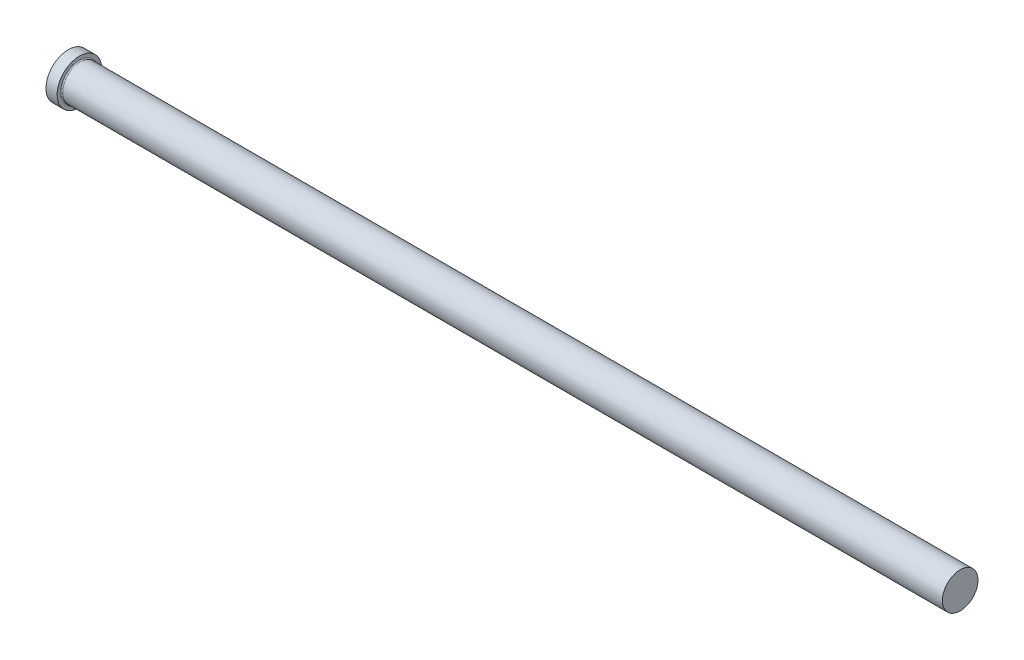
ISO-10303-21;
HEADER;
FILE_DESCRIPTION(('STEP AP214'),'2;1');
FILE_NAME('part.step','',(''),(''),'','','');
FILE_SCHEMA(('AUTOMOTIVE_DESIGN { 1 0 10303 214 1 1 1 1 }'));
ENDSEC;
DATA;
#1=APPLICATION_CONTEXT('core data for automotive mechanical design processes');
#2=APPLICATION_PROTOCOL_DEFINITION('international standard','automotive_design',2000,#1);
#3=PRODUCT_CONTEXT('',#1,'mechanical');
#4=PRODUCT('Part','Part','',(#3));
#5=PRODUCT_RELATED_PRODUCT_CATEGORY('part','',(#4));
#6=PRODUCT_DEFINITION_FORMATION('','',#4);
#7=PRODUCT_DEFINITION_CONTEXT('part definition',#1,'design');
#8=PRODUCT_DEFINITION('design','',#6,#7);
#9=PRODUCT_DEFINITION_SHAPE('','',#8);
#10=(LENGTH_UNIT() NAMED_UNIT(*) SI_UNIT(.MILLI.,.METRE.));
#11=(NAMED_UNIT(*) PLANE_ANGLE_UNIT() SI_UNIT($,.RADIAN.));
#12=(NAMED_UNIT(*) SI_UNIT($,.STERADIAN.) SOLID_ANGLE_UNIT());
#13=UNCERTAINTY_MEASURE_WITH_UNIT(LENGTH_MEASURE(1.E-05),#10,'distance_accuracy_value','');
#14=(GEOMETRIC_REPRESENTATION_CONTEXT(3) GLOBAL_UNCERTAINTY_ASSIGNED_CONTEXT((#13)) GLOBAL_UNIT_ASSIGNED_CONTEXT((#10,
#11,#12)) REPRESENTATION_CONTEXT('',''));
#15=CARTESIAN_POINT('',(0.,0.,0.));
#16=DIRECTION('',(0.,0.,1.));
#17=DIRECTION('',(1.,0.,0.));
#18=AXIS2_PLACEMENT_3D('',#15,#16,#17);
#19=CARTESIAN_POINT('',(0.,0.,0.));
#20=DIRECTION('',(-1.,0.,0.));
#21=DIRECTION('',(0.,-1.,0.));
#22=AXIS2_PLACEMENT_3D('',#19,#20,#21);
#23=PLANE('',#22);
#24=CARTESIAN_POINT('',(0.,0.,0.));
#25=DIRECTION('',(1.,0.,0.));
#26=DIRECTION('',(0.,1.,0.));
#27=AXIS2_PLACEMENT_3D('',#24,#25,#26);
#28=CIRCLE('',#27,20.);
#29=CARTESIAN_POINT('',(0.,20.,0.));
#30=VERTEX_POINT('',#29);
#31=EDGE_CURVE('E25',#30,#30,#28,.T.);
#32=ORIENTED_EDGE('',*,*,#31,.F.);
#33=EDGE_LOOP('',(#32));
#34=FACE_BOUND('',#33,.T.);
#35=ADVANCED_FACE('F14',(#34),#23,.T.);
#36=CARTESIAN_POINT('',(800.,0.,0.));
#37=DIRECTION('',(1.,0.,0.));
#38=DIRECTION('',(0.,1.,0.));
#39=AXIS2_PLACEMENT_3D('',#36,#37,#38);
#40=CYLINDRICAL_SURFACE('',#39,20.);
#41=ORIENTED_EDGE('',*,*,#31,.T.);
#42=EDGE_LOOP('',(#41));
#43=FACE_BOUND('',#42,.T.);
#44=CARTESIAN_POINT('',(10.,0.,0.));
#45=DIRECTION('',(1.,0.,0.));
#46=DIRECTION('',(0.,1.,0.));
#47=AXIS2_PLACEMENT_3D('',#44,#45,#46);
#48=CIRCLE('',#47,20.);
#49=CARTESIAN_POINT('',(10.,20.,0.));
#50=VERTEX_POINT('',#49);
#51=EDGE_CURVE('E29',#50,#50,#48,.T.);
#52=ORIENTED_EDGE('',*,*,#51,.F.);
#53=EDGE_LOOP('',(#52));
#54=FACE_BOUND('',#53,.T.);
#55=ADVANCED_FACE('F51',(#43,#54),#40,.T.);
#56=CARTESIAN_POINT('',(10.,20.,0.));
#57=DIRECTION('',(1.,0.,0.));
#58=DIRECTION('',(0.,1.,0.));
#59=AXIS2_PLACEMENT_3D('',#56,#57,#58);
#60=PLANE('',#59);
#61=CARTESIAN_POINT('',(10.,0.,0.));
#62=DIRECTION('',(1.,0.,0.));
#63=DIRECTION('',(0.,1.,0.));
#64=AXIS2_PLACEMENT_3D('',#61,#62,#63);
#65=CIRCLE('',#64,17.);
#66=CARTESIAN_POINT('',(10.,17.,0.));
#67=VERTEX_POINT('',#66);
#68=EDGE_CURVE('E9',#67,#67,#65,.F.);
#69=ORIENTED_EDGE('',*,*,#68,.T.);
#70=EDGE_LOOP('',(#69));
#71=FACE_BOUND('',#70,.T.);
#72=ORIENTED_EDGE('',*,*,#51,.T.);
#73=EDGE_LOOP('',(#72));
#74=FACE_BOUND('',#73,.T.);
#75=ADVANCED_FACE('F42',(#71,#74),#60,.T.);
#76=CARTESIAN_POINT('',(800.,0.,0.));
#77=DIRECTION('',(1.,0.,0.));
#78=DIRECTION('',(0.,1.,0.));
#79=AXIS2_PLACEMENT_3D('',#76,#77,#78);
#80=CYLINDRICAL_SURFACE('',#79,16.);
#81=CARTESIAN_POINT('',(11.,0.,0.));
#82=DIRECTION('',(1.,0.,0.));
#83=DIRECTION('',(0.,1.,0.));
#84=AXIS2_PLACEMENT_3D('',#81,#82,#83);
#85=CIRCLE('',#84,16.);
#86=CARTESIAN_POINT('',(11.,16.,0.));
#87=VERTEX_POINT('',#86);
#88=EDGE_CURVE('E21',#87,#87,#85,.T.);
#89=ORIENTED_EDGE('',*,*,#88,.T.);
#90=EDGE_LOOP('',(#89));
#91=FACE_BOUND('',#90,.T.);
#92=CARTESIAN_POINT('',(800.,0.,0.));
#93=DIRECTION('',(1.,0.,0.));
#94=DIRECTION('',(0.,1.,0.));
#95=AXIS2_PLACEMENT_3D('',#92,#93,#94);
#96=CIRCLE('',#95,16.);
#97=CARTESIAN_POINT('',(800.,16.,0.));
#98=VERTEX_POINT('',#97);
#99=EDGE_CURVE('E34',#98,#98,#96,.T.);
#100=ORIENTED_EDGE('',*,*,#99,.F.);
#101=EDGE_LOOP('',(#100));
#102=FACE_BOUND('',#101,.T.);
#103=ADVANCED_FACE('F40',(#91,#102),#80,.T.);
#104=CARTESIAN_POINT('',(800.,16.,0.));
#105=DIRECTION('',(1.,0.,0.));
#106=DIRECTION('',(0.,1.,0.));
#107=AXIS2_PLACEMENT_3D('',#104,#105,#106);
#108=PLANE('',#107);
#109=ORIENTED_EDGE('',*,*,#99,.T.);
#110=EDGE_LOOP('',(#109));
#111=FACE_BOUND('',#110,.T.);
#112=ADVANCED_FACE('F38',(#111),#108,.T.);
#113=CARTESIAN_POINT('',(11.,0.,0.));
#114=DIRECTION('',(1.,0.,0.));
#115=DIRECTION('',(0.,1.,0.));
#116=AXIS2_PLACEMENT_3D('',#113,#114,#115);
#117=TOROIDAL_SURFACE('',#116,17.,1.);
#118=ORIENTED_EDGE('',*,*,#68,.F.);
#119=EDGE_LOOP('',(#118));
#120=FACE_BOUND('',#119,.T.);
#121=ORIENTED_EDGE('',*,*,#88,.F.);
#122=EDGE_LOOP('',(#121));
#123=FACE_BOUND('',#122,.T.);
#124=ADVANCED_FACE('F16',(#120,#123),#117,.F.);
#125=CLOSED_SHELL('',(#35,#55,#75,#103,#112,#124));
#126=MANIFOLD_SOLID_BREP('B1',#125);
#127=ADVANCED_BREP_SHAPE_REPRESENTATION('',(#18,#126),#14);
#128=SHAPE_DEFINITION_REPRESENTATION(#9,#127);
ENDSEC;
END-ISO-10303-21;
